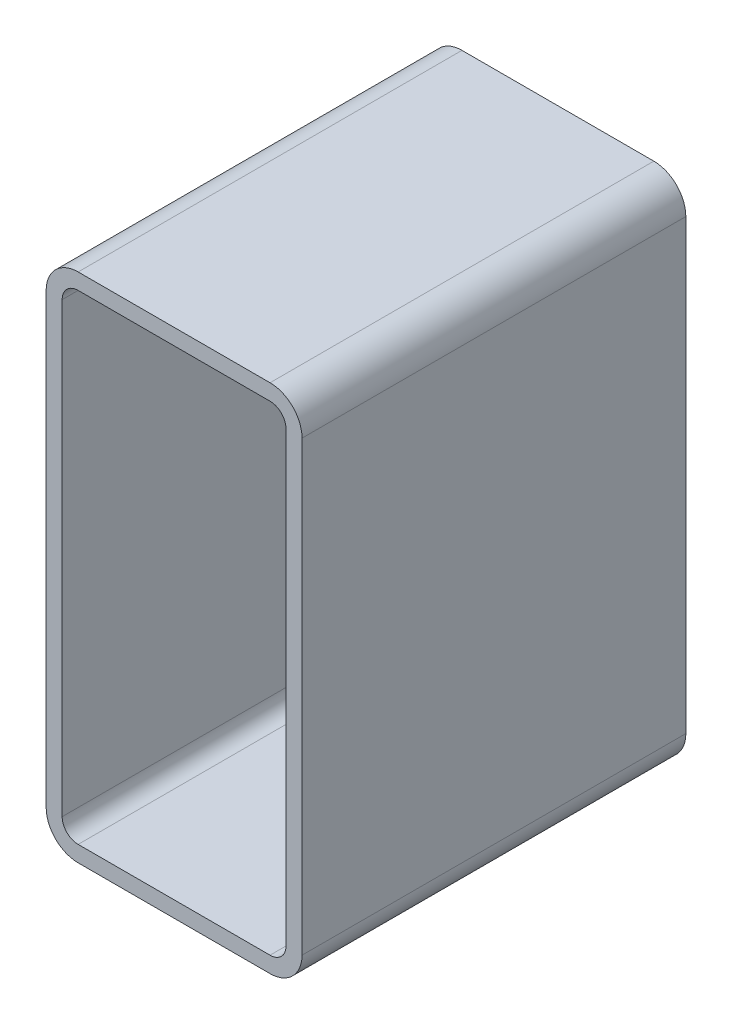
ISO-10303-21;
HEADER;
FILE_DESCRIPTION(('STEP AP214'),'2;1');
FILE_NAME('part.step','',(''),(''),'','','');
FILE_SCHEMA(('AUTOMOTIVE_DESIGN { 1 0 10303 214 1 1 1 1 }'));
ENDSEC;
DATA;
#1=APPLICATION_CONTEXT('core data for automotive mechanical design processes');
#2=APPLICATION_PROTOCOL_DEFINITION('international standard','automotive_design',2000,#1);
#3=PRODUCT_CONTEXT('',#1,'mechanical');
#4=PRODUCT('Part','Part','',(#3));
#5=PRODUCT_RELATED_PRODUCT_CATEGORY('part','',(#4));
#6=PRODUCT_DEFINITION_FORMATION('','',#4);
#7=PRODUCT_DEFINITION_CONTEXT('part definition',#1,'design');
#8=PRODUCT_DEFINITION('design','',#6,#7);
#9=PRODUCT_DEFINITION_SHAPE('','',#8);
#10=(LENGTH_UNIT() NAMED_UNIT(*) SI_UNIT(.MILLI.,.METRE.));
#11=(NAMED_UNIT(*) PLANE_ANGLE_UNIT() SI_UNIT($,.RADIAN.));
#12=(NAMED_UNIT(*) SI_UNIT($,.STERADIAN.) SOLID_ANGLE_UNIT());
#13=UNCERTAINTY_MEASURE_WITH_UNIT(LENGTH_MEASURE(1.E-05),#10,'distance_accuracy_value','');
#14=(GEOMETRIC_REPRESENTATION_CONTEXT(3) GLOBAL_UNCERTAINTY_ASSIGNED_CONTEXT((#13)) GLOBAL_UNIT_ASSIGNED_CONTEXT((#10,
#11,#12)) REPRESENTATION_CONTEXT('',''));
#15=CARTESIAN_POINT('',(0.,0.,0.));
#16=DIRECTION('',(0.,0.,1.));
#17=DIRECTION('',(1.,0.,0.));
#18=AXIS2_PLACEMENT_3D('',#15,#16,#17);
#19=CARTESIAN_POINT('',(26.7909404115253,382.78286249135,304.8));
#20=DIRECTION('',(0.,0.,1.));
#21=DIRECTION('',(1.,0.,0.));
#22=AXIS2_PLACEMENT_3D('',#19,#20,#21);
#23=PLANE('',#22);
#24=CARTESIAN_POINT('',(26.7909404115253,382.78286249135,304.8));
#25=DIRECTION('',(0.,0.,1.));
#26=DIRECTION('',(1.,0.,0.));
#27=AXIS2_PLACEMENT_3D('',#24,#25,#26);
#28=CIRCLE('',#27,25.4);
#29=CARTESIAN_POINT('',(26.7909404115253,408.18286249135,304.8));
#30=VERTEX_POINT('',#29);
#31=CARTESIAN_POINT('',(1.3909404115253,382.78286249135,304.8));
#32=VERTEX_POINT('',#31);
#33=EDGE_CURVE('E211',#30,#32,#28,.T.);
#34=ORIENTED_EDGE('',*,*,#33,.T.);
#35=DIRECTION('',(0.,-1.,0.));
#36=VECTOR('',#35,1.);
#37=CARTESIAN_POINT('',(1.3909404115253,27.1828624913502,304.8));
#38=LINE('',#37,#36);
#39=CARTESIAN_POINT('',(1.3909404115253,27.1828624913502,304.8));
#40=VERTEX_POINT('',#39);
#41=EDGE_CURVE('E214',#32,#40,#38,.T.);
#42=ORIENTED_EDGE('',*,*,#41,.T.);
#43=CARTESIAN_POINT('',(26.7909404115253,27.1828624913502,304.8));
#44=DIRECTION('',(0.,0.,1.));
#45=DIRECTION('',(1.,0.,0.));
#46=AXIS2_PLACEMENT_3D('',#43,#44,#45);
#47=CIRCLE('',#46,25.4);
#48=CARTESIAN_POINT('',(26.7909404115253,1.78286249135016,304.8));
#49=VERTEX_POINT('',#48);
#50=EDGE_CURVE('E217',#40,#49,#47,.T.);
#51=ORIENTED_EDGE('',*,*,#50,.T.);
#52=DIRECTION('',(1.,0.,0.));
#53=VECTOR('',#52,1.);
#54=CARTESIAN_POINT('',(179.190940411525,1.78286249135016,304.8));
#55=LINE('',#54,#53);
#56=CARTESIAN_POINT('',(179.190940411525,1.78286249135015,304.8));
#57=VERTEX_POINT('',#56);
#58=EDGE_CURVE('E219',#49,#57,#55,.T.);
#59=ORIENTED_EDGE('',*,*,#58,.T.);
#60=CARTESIAN_POINT('',(179.190940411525,27.1828624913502,304.8));
#61=DIRECTION('',(0.,0.,1.));
#62=DIRECTION('',(1.,0.,0.));
#63=AXIS2_PLACEMENT_3D('',#60,#61,#62);
#64=CIRCLE('',#63,25.4);
#65=CARTESIAN_POINT('',(204.590940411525,27.1828624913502,304.8));
#66=VERTEX_POINT('',#65);
#67=EDGE_CURVE('E221',#57,#66,#64,.T.);
#68=ORIENTED_EDGE('',*,*,#67,.T.);
#69=DIRECTION('',(0.,1.,0.));
#70=VECTOR('',#69,1.);
#71=CARTESIAN_POINT('',(204.590940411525,382.78286249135,304.8));
#72=LINE('',#71,#70);
#73=CARTESIAN_POINT('',(204.590940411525,382.78286249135,304.8));
#74=VERTEX_POINT('',#73);
#75=EDGE_CURVE('E223',#66,#74,#72,.T.);
#76=ORIENTED_EDGE('',*,*,#75,.T.);
#77=CARTESIAN_POINT('',(179.190940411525,382.78286249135,304.8));
#78=DIRECTION('',(0.,0.,1.));
#79=DIRECTION('',(1.,0.,0.));
#80=AXIS2_PLACEMENT_3D('',#77,#78,#79);
#81=CIRCLE('',#80,25.4);
#82=CARTESIAN_POINT('',(179.190940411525,408.18286249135,304.8));
#83=VERTEX_POINT('',#82);
#84=EDGE_CURVE('E225',#74,#83,#81,.T.);
#85=ORIENTED_EDGE('',*,*,#84,.T.);
#86=DIRECTION('',(-1.,0.,0.));
#87=VECTOR('',#86,1.);
#88=CARTESIAN_POINT('',(26.7909404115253,408.18286249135,304.8));
#89=LINE('',#88,#87);
#90=EDGE_CURVE('E227',#83,#30,#89,.T.);
#91=ORIENTED_EDGE('',*,*,#90,.T.);
#92=EDGE_LOOP('',(#34,#42,#51,#59,#68,#76,#85,#91));
#93=FACE_BOUND('',#92,.T.);
#94=DIRECTION('',(0.,-1.,0.));
#95=VECTOR('',#94,1.);
#96=CARTESIAN_POINT('',(14.0909404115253,27.1828624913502,304.8));
#97=LINE('',#96,#95);
#98=CARTESIAN_POINT('',(14.0909404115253,382.78286249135,304.8));
#99=VERTEX_POINT('',#98);
#100=CARTESIAN_POINT('',(14.0909404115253,27.1828624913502,304.8));
#101=VERTEX_POINT('',#100);
#102=EDGE_CURVE('E154',#99,#101,#97,.T.);
#103=ORIENTED_EDGE('',*,*,#102,.F.);
#104=CARTESIAN_POINT('',(26.7909404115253,382.78286249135,304.8));
#105=DIRECTION('',(0.,0.,1.));
#106=DIRECTION('',(1.,0.,0.));
#107=AXIS2_PLACEMENT_3D('',#104,#105,#106);
#108=CIRCLE('',#107,12.7);
#109=CARTESIAN_POINT('',(26.7909404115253,395.48286249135,304.8));
#110=VERTEX_POINT('',#109);
#111=EDGE_CURVE('E146',#110,#99,#108,.T.);
#112=ORIENTED_EDGE('',*,*,#111,.F.);
#113=DIRECTION('',(-1.,0.,0.));
#114=VECTOR('',#113,1.);
#115=CARTESIAN_POINT('',(26.7909404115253,395.48286249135,304.8));
#116=LINE('',#115,#114);
#117=CARTESIAN_POINT('',(179.190940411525,395.48286249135,304.8));
#118=VERTEX_POINT('',#117);
#119=EDGE_CURVE('E179',#118,#110,#116,.T.);
#120=ORIENTED_EDGE('',*,*,#119,.F.);
#121=CARTESIAN_POINT('',(179.190940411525,382.78286249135,304.8));
#122=DIRECTION('',(0.,0.,1.));
#123=DIRECTION('',(1.,0.,0.));
#124=AXIS2_PLACEMENT_3D('',#121,#122,#123);
#125=CIRCLE('',#124,12.7000000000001);
#126=CARTESIAN_POINT('',(191.890940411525,382.78286249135,304.8));
#127=VERTEX_POINT('',#126);
#128=EDGE_CURVE('E177',#127,#118,#125,.T.);
#129=ORIENTED_EDGE('',*,*,#128,.F.);
#130=DIRECTION('',(0.,1.,0.));
#131=VECTOR('',#130,1.);
#132=CARTESIAN_POINT('',(191.890940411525,382.78286249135,304.8));
#133=LINE('',#132,#131);
#134=CARTESIAN_POINT('',(191.890940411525,27.1828624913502,304.8));
#135=VERTEX_POINT('',#134);
#136=EDGE_CURVE('E175',#135,#127,#133,.T.);
#137=ORIENTED_EDGE('',*,*,#136,.F.);
#138=CARTESIAN_POINT('',(179.190940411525,27.1828624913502,304.8));
#139=DIRECTION('',(0.,0.,1.));
#140=DIRECTION('',(1.,0.,0.));
#141=AXIS2_PLACEMENT_3D('',#138,#139,#140);
#142=CIRCLE('',#141,12.7);
#143=CARTESIAN_POINT('',(179.190940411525,14.4828624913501,304.8));
#144=VERTEX_POINT('',#143);
#145=EDGE_CURVE('E173',#144,#135,#142,.T.);
#146=ORIENTED_EDGE('',*,*,#145,.F.);
#147=DIRECTION('',(1.,0.,0.));
#148=VECTOR('',#147,1.);
#149=CARTESIAN_POINT('',(179.190940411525,14.4828624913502,304.8));
#150=LINE('',#149,#148);
#151=CARTESIAN_POINT('',(26.7909404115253,14.4828624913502,304.8));
#152=VERTEX_POINT('',#151);
#153=EDGE_CURVE('E169',#152,#144,#150,.T.);
#154=ORIENTED_EDGE('',*,*,#153,.F.);
#155=CARTESIAN_POINT('',(26.7909404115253,27.1828624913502,304.8));
#156=DIRECTION('',(0.,0.,1.));
#157=DIRECTION('',(1.,0.,0.));
#158=AXIS2_PLACEMENT_3D('',#155,#156,#157);
#159=CIRCLE('',#158,12.7);
#160=EDGE_CURVE('E167',#101,#152,#159,.T.);
#161=ORIENTED_EDGE('',*,*,#160,.F.);
#162=EDGE_LOOP('',(#103,#112,#120,#129,#137,#146,#154,#161));
#163=FACE_BOUND('',#162,.T.);
#164=ADVANCED_FACE('F33',(#93,#163),#23,.T.);
#165=CARTESIAN_POINT('',(26.7909404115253,382.78286249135,0.));
#166=DIRECTION('',(0.,0.,1.));
#167=DIRECTION('',(1.,0.,0.));
#168=AXIS2_PLACEMENT_3D('',#165,#166,#167);
#169=PLANE('',#168);
#170=CARTESIAN_POINT('',(26.7909404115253,382.78286249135,0.));
#171=DIRECTION('',(0.,0.,1.));
#172=DIRECTION('',(1.,0.,0.));
#173=AXIS2_PLACEMENT_3D('',#170,#171,#172);
#174=CIRCLE('',#173,25.4);
#175=CARTESIAN_POINT('',(26.7909404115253,408.18286249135,0.));
#176=VERTEX_POINT('',#175);
#177=CARTESIAN_POINT('',(1.3909404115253,382.78286249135,0.));
#178=VERTEX_POINT('',#177);
#179=EDGE_CURVE('E162',#176,#178,#174,.T.);
#180=ORIENTED_EDGE('',*,*,#179,.F.);
#181=DIRECTION('',(-1.,0.,0.));
#182=VECTOR('',#181,1.);
#183=CARTESIAN_POINT('',(26.7909404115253,408.18286249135,0.));
#184=LINE('',#183,#182);
#185=CARTESIAN_POINT('',(179.190940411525,408.18286249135,0.));
#186=VERTEX_POINT('',#185);
#187=EDGE_CURVE('E215',#186,#176,#184,.T.);
#188=ORIENTED_EDGE('',*,*,#187,.F.);
#189=CARTESIAN_POINT('',(179.190940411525,382.78286249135,0.));
#190=DIRECTION('',(0.,0.,1.));
#191=DIRECTION('',(1.,0.,0.));
#192=AXIS2_PLACEMENT_3D('',#189,#190,#191);
#193=CIRCLE('',#192,25.4);
#194=CARTESIAN_POINT('',(204.590940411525,382.78286249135,0.));
#195=VERTEX_POINT('',#194);
#196=EDGE_CURVE('E242',#195,#186,#193,.T.);
#197=ORIENTED_EDGE('',*,*,#196,.F.);
#198=DIRECTION('',(0.,1.,0.));
#199=VECTOR('',#198,1.);
#200=CARTESIAN_POINT('',(204.590940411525,382.78286249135,0.));
#201=LINE('',#200,#199);
#202=CARTESIAN_POINT('',(204.590940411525,27.1828624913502,0.));
#203=VERTEX_POINT('',#202);
#204=EDGE_CURVE('E240',#203,#195,#201,.T.);
#205=ORIENTED_EDGE('',*,*,#204,.F.);
#206=CARTESIAN_POINT('',(179.190940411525,27.1828624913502,0.));
#207=DIRECTION('',(0.,0.,1.));
#208=DIRECTION('',(1.,0.,0.));
#209=AXIS2_PLACEMENT_3D('',#206,#207,#208);
#210=CIRCLE('',#209,25.4);
#211=CARTESIAN_POINT('',(179.190940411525,1.78286249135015,0.));
#212=VERTEX_POINT('',#211);
#213=EDGE_CURVE('E238',#212,#203,#210,.T.);
#214=ORIENTED_EDGE('',*,*,#213,.F.);
#215=DIRECTION('',(1.,0.,0.));
#216=VECTOR('',#215,1.);
#217=CARTESIAN_POINT('',(179.190940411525,1.78286249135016,0.));
#218=LINE('',#217,#216);
#219=CARTESIAN_POINT('',(26.7909404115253,1.78286249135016,0.));
#220=VERTEX_POINT('',#219);
#221=EDGE_CURVE('E236',#220,#212,#218,.T.);
#222=ORIENTED_EDGE('',*,*,#221,.F.);
#223=CARTESIAN_POINT('',(26.7909404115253,27.1828624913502,0.));
#224=DIRECTION('',(0.,0.,1.));
#225=DIRECTION('',(1.,0.,0.));
#226=AXIS2_PLACEMENT_3D('',#223,#224,#225);
#227=CIRCLE('',#226,25.4);
#228=CARTESIAN_POINT('',(1.3909404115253,27.1828624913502,0.));
#229=VERTEX_POINT('',#228);
#230=EDGE_CURVE('E234',#229,#220,#227,.T.);
#231=ORIENTED_EDGE('',*,*,#230,.F.);
#232=DIRECTION('',(0.,-1.,0.));
#233=VECTOR('',#232,1.);
#234=CARTESIAN_POINT('',(1.3909404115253,27.1828624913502,0.));
#235=LINE('',#234,#233);
#236=EDGE_CURVE('E232',#178,#229,#235,.T.);
#237=ORIENTED_EDGE('',*,*,#236,.F.);
#238=EDGE_LOOP('',(#180,#188,#197,#205,#214,#222,#231,#237));
#239=FACE_BOUND('',#238,.T.);
#240=CARTESIAN_POINT('',(26.7909404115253,382.78286249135,0.));
#241=DIRECTION('',(0.,0.,1.));
#242=DIRECTION('',(1.,0.,0.));
#243=AXIS2_PLACEMENT_3D('',#240,#241,#242);
#244=CIRCLE('',#243,12.7);
#245=CARTESIAN_POINT('',(26.7909404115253,395.48286249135,0.));
#246=VERTEX_POINT('',#245);
#247=CARTESIAN_POINT('',(14.0909404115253,382.78286249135,0.));
#248=VERTEX_POINT('',#247);
#249=EDGE_CURVE('E56',#246,#248,#244,.T.);
#250=ORIENTED_EDGE('',*,*,#249,.T.);
#251=DIRECTION('',(0.,-1.,0.));
#252=VECTOR('',#251,1.);
#253=CARTESIAN_POINT('',(14.0909404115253,27.1828624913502,0.));
#254=LINE('',#253,#252);
#255=CARTESIAN_POINT('',(14.0909404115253,27.1828624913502,0.));
#256=VERTEX_POINT('',#255);
#257=EDGE_CURVE('E161',#248,#256,#254,.T.);
#258=ORIENTED_EDGE('',*,*,#257,.T.);
#259=CARTESIAN_POINT('',(26.7909404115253,27.1828624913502,0.));
#260=DIRECTION('',(0.,0.,1.));
#261=DIRECTION('',(1.,0.,0.));
#262=AXIS2_PLACEMENT_3D('',#259,#260,#261);
#263=CIRCLE('',#262,12.7);
#264=CARTESIAN_POINT('',(26.7909404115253,14.4828624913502,0.));
#265=VERTEX_POINT('',#264);
#266=EDGE_CURVE('E183',#256,#265,#263,.T.);
#267=ORIENTED_EDGE('',*,*,#266,.T.);
#268=DIRECTION('',(1.,0.,0.));
#269=VECTOR('',#268,1.);
#270=CARTESIAN_POINT('',(179.190940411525,14.4828624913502,0.));
#271=LINE('',#270,#269);
#272=CARTESIAN_POINT('',(179.190940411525,14.4828624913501,0.));
#273=VERTEX_POINT('',#272);
#274=EDGE_CURVE('E186',#265,#273,#271,.T.);
#275=ORIENTED_EDGE('',*,*,#274,.T.);
#276=CARTESIAN_POINT('',(179.190940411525,27.1828624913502,0.));
#277=DIRECTION('',(0.,0.,1.));
#278=DIRECTION('',(1.,0.,0.));
#279=AXIS2_PLACEMENT_3D('',#276,#277,#278);
#280=CIRCLE('',#279,12.7);
#281=CARTESIAN_POINT('',(191.890940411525,27.1828624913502,0.));
#282=VERTEX_POINT('',#281);
#283=EDGE_CURVE('E189',#273,#282,#280,.T.);
#284=ORIENTED_EDGE('',*,*,#283,.T.);
#285=DIRECTION('',(0.,1.,0.));
#286=VECTOR('',#285,1.);
#287=CARTESIAN_POINT('',(191.890940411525,382.78286249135,0.));
#288=LINE('',#287,#286);
#289=CARTESIAN_POINT('',(191.890940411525,382.78286249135,0.));
#290=VERTEX_POINT('',#289);
#291=EDGE_CURVE('E192',#282,#290,#288,.T.);
#292=ORIENTED_EDGE('',*,*,#291,.T.);
#293=CARTESIAN_POINT('',(179.190940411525,382.78286249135,0.));
#294=DIRECTION('',(0.,0.,1.));
#295=DIRECTION('',(1.,0.,0.));
#296=AXIS2_PLACEMENT_3D('',#293,#294,#295);
#297=CIRCLE('',#296,12.7000000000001);
#298=CARTESIAN_POINT('',(179.190940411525,395.48286249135,0.));
#299=VERTEX_POINT('',#298);
#300=EDGE_CURVE('E195',#290,#299,#297,.T.);
#301=ORIENTED_EDGE('',*,*,#300,.T.);
#302=DIRECTION('',(-1.,0.,0.));
#303=VECTOR('',#302,1.);
#304=CARTESIAN_POINT('',(26.7909404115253,395.48286249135,0.));
#305=LINE('',#304,#303);
#306=EDGE_CURVE('E155',#299,#246,#305,.T.);
#307=ORIENTED_EDGE('',*,*,#306,.T.);
#308=EDGE_LOOP('',(#250,#258,#267,#275,#284,#292,#301,#307));
#309=FACE_BOUND('',#308,.T.);
#310=ADVANCED_FACE('F272',(#239,#309),#169,.F.);
#311=CARTESIAN_POINT('',(26.7909404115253,382.78286249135,304.8));
#312=DIRECTION('',(0.,0.,-1.));
#313=DIRECTION('',(-1.,0.,0.));
#314=AXIS2_PLACEMENT_3D('',#311,#312,#313);
#315=CYLINDRICAL_SURFACE('',#314,25.4);
#316=ORIENTED_EDGE('',*,*,#179,.T.);
#317=DIRECTION('',(0.,0.,-1.));
#318=VECTOR('',#317,1.);
#319=CARTESIAN_POINT('',(1.3909404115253,382.78286249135,304.8));
#320=LINE('',#319,#318);
#321=EDGE_CURVE('E11',#32,#178,#320,.T.);
#322=ORIENTED_EDGE('',*,*,#321,.F.);
#323=ORIENTED_EDGE('',*,*,#33,.F.);
#324=DIRECTION('',(0.,0.,-1.));
#325=VECTOR('',#324,1.);
#326=CARTESIAN_POINT('',(26.7909404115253,408.18286249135,304.8));
#327=LINE('',#326,#325);
#328=EDGE_CURVE('E229',#30,#176,#327,.T.);
#329=ORIENTED_EDGE('',*,*,#328,.T.);
#330=EDGE_LOOP('',(#316,#322,#323,#329));
#331=FACE_BOUND('',#330,.T.);
#332=ADVANCED_FACE('F35',(#331),#315,.T.);
#333=CARTESIAN_POINT('',(1.3909404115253,27.1828624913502,304.8));
#334=DIRECTION('',(1.,0.,0.));
#335=DIRECTION('',(0.,0.,-1.));
#336=AXIS2_PLACEMENT_3D('',#333,#334,#335);
#337=PLANE('',#336);
#338=ORIENTED_EDGE('',*,*,#236,.T.);
#339=DIRECTION('',(0.,0.,-1.));
#340=VECTOR('',#339,1.);
#341=CARTESIAN_POINT('',(1.3909404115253,27.1828624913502,304.8));
#342=LINE('',#341,#340);
#343=EDGE_CURVE('E41',#40,#229,#342,.T.);
#344=ORIENTED_EDGE('',*,*,#343,.F.);
#345=ORIENTED_EDGE('',*,*,#41,.F.);
#346=ORIENTED_EDGE('',*,*,#321,.T.);
#347=EDGE_LOOP('',(#338,#344,#345,#346));
#348=FACE_BOUND('',#347,.T.);
#349=ADVANCED_FACE('F289',(#348),#337,.F.);
#350=CARTESIAN_POINT('',(26.7909404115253,27.1828624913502,304.8));
#351=DIRECTION('',(0.,0.,-1.));
#352=DIRECTION('',(-1.,0.,0.));
#353=AXIS2_PLACEMENT_3D('',#350,#351,#352);
#354=CYLINDRICAL_SURFACE('',#353,25.4);
#355=ORIENTED_EDGE('',*,*,#230,.T.);
#356=DIRECTION('',(0.,0.,-1.));
#357=VECTOR('',#356,1.);
#358=CARTESIAN_POINT('',(26.7909404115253,1.78286249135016,304.8));
#359=LINE('',#358,#357);
#360=EDGE_CURVE('E259',#49,#220,#359,.T.);
#361=ORIENTED_EDGE('',*,*,#360,.F.);
#362=ORIENTED_EDGE('',*,*,#50,.F.);
#363=ORIENTED_EDGE('',*,*,#343,.T.);
#364=EDGE_LOOP('',(#355,#361,#362,#363));
#365=FACE_BOUND('',#364,.T.);
#366=ADVANCED_FACE('F266',(#365),#354,.T.);
#367=CARTESIAN_POINT('',(179.190940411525,1.78286249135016,304.8));
#368=DIRECTION('',(0.,1.,0.));
#369=DIRECTION('',(0.,0.,1.));
#370=AXIS2_PLACEMENT_3D('',#367,#368,#369);
#371=PLANE('',#370);
#372=ORIENTED_EDGE('',*,*,#221,.T.);
#373=DIRECTION('',(0.,0.,-1.));
#374=VECTOR('',#373,1.);
#375=CARTESIAN_POINT('',(179.190940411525,1.78286249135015,304.8));
#376=LINE('',#375,#374);
#377=EDGE_CURVE('E256',#57,#212,#376,.T.);
#378=ORIENTED_EDGE('',*,*,#377,.F.);
#379=ORIENTED_EDGE('',*,*,#58,.F.);
#380=ORIENTED_EDGE('',*,*,#360,.T.);
#381=EDGE_LOOP('',(#372,#378,#379,#380));
#382=FACE_BOUND('',#381,.T.);
#383=ADVANCED_FACE('F278',(#382),#371,.F.);
#384=CARTESIAN_POINT('',(179.190940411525,27.1828624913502,304.8));
#385=DIRECTION('',(0.,0.,-1.));
#386=DIRECTION('',(-1.,0.,0.));
#387=AXIS2_PLACEMENT_3D('',#384,#385,#386);
#388=CYLINDRICAL_SURFACE('',#387,25.4);
#389=ORIENTED_EDGE('',*,*,#213,.T.);
#390=DIRECTION('',(0.,0.,-1.));
#391=VECTOR('',#390,1.);
#392=CARTESIAN_POINT('',(204.590940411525,27.1828624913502,304.8));
#393=LINE('',#392,#391);
#394=EDGE_CURVE('E253',#66,#203,#393,.T.);
#395=ORIENTED_EDGE('',*,*,#394,.F.);
#396=ORIENTED_EDGE('',*,*,#67,.F.);
#397=ORIENTED_EDGE('',*,*,#377,.T.);
#398=EDGE_LOOP('',(#389,#395,#396,#397));
#399=FACE_BOUND('',#398,.T.);
#400=ADVANCED_FACE('F282',(#399),#388,.T.);
#401=CARTESIAN_POINT('',(204.590940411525,382.78286249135,304.8));
#402=DIRECTION('',(-1.,0.,0.));
#403=DIRECTION('',(0.,0.,1.));
#404=AXIS2_PLACEMENT_3D('',#401,#402,#403);
#405=PLANE('',#404);
#406=ORIENTED_EDGE('',*,*,#204,.T.);
#407=DIRECTION('',(0.,0.,-1.));
#408=VECTOR('',#407,1.);
#409=CARTESIAN_POINT('',(204.590940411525,382.78286249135,304.8));
#410=LINE('',#409,#408);
#411=EDGE_CURVE('E250',#74,#195,#410,.T.);
#412=ORIENTED_EDGE('',*,*,#411,.F.);
#413=ORIENTED_EDGE('',*,*,#75,.F.);
#414=ORIENTED_EDGE('',*,*,#394,.T.);
#415=EDGE_LOOP('',(#406,#412,#413,#414));
#416=FACE_BOUND('',#415,.T.);
#417=ADVANCED_FACE('F302',(#416),#405,.F.);
#418=CARTESIAN_POINT('',(179.190940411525,382.78286249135,304.8));
#419=DIRECTION('',(0.,0.,-1.));
#420=DIRECTION('',(-1.,0.,0.));
#421=AXIS2_PLACEMENT_3D('',#418,#419,#420);
#422=CYLINDRICAL_SURFACE('',#421,25.4);
#423=ORIENTED_EDGE('',*,*,#196,.T.);
#424=DIRECTION('',(0.,0.,-1.));
#425=VECTOR('',#424,1.);
#426=CARTESIAN_POINT('',(179.190940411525,408.18286249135,304.8));
#427=LINE('',#426,#425);
#428=EDGE_CURVE('E247',#83,#186,#427,.T.);
#429=ORIENTED_EDGE('',*,*,#428,.F.);
#430=ORIENTED_EDGE('',*,*,#84,.F.);
#431=ORIENTED_EDGE('',*,*,#411,.T.);
#432=EDGE_LOOP('',(#423,#429,#430,#431));
#433=FACE_BOUND('',#432,.T.);
#434=ADVANCED_FACE('F300',(#433),#422,.T.);
#435=CARTESIAN_POINT('',(26.7909404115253,408.18286249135,304.8));
#436=DIRECTION('',(0.,-1.,0.));
#437=DIRECTION('',(0.,0.,-1.));
#438=AXIS2_PLACEMENT_3D('',#435,#436,#437);
#439=PLANE('',#438);
#440=ORIENTED_EDGE('',*,*,#187,.T.);
#441=ORIENTED_EDGE('',*,*,#328,.F.);
#442=ORIENTED_EDGE('',*,*,#90,.F.);
#443=ORIENTED_EDGE('',*,*,#428,.T.);
#444=EDGE_LOOP('',(#440,#441,#442,#443));
#445=FACE_BOUND('',#444,.T.);
#446=ADVANCED_FACE('F295',(#445),#439,.F.);
#447=CARTESIAN_POINT('',(26.7909404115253,382.78286249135,304.8));
#448=DIRECTION('',(0.,0.,-1.));
#449=DIRECTION('',(-1.,0.,0.));
#450=AXIS2_PLACEMENT_3D('',#447,#448,#449);
#451=CYLINDRICAL_SURFACE('',#450,12.7);
#452=ORIENTED_EDGE('',*,*,#249,.F.);
#453=DIRECTION('',(0.,0.,-1.));
#454=VECTOR('',#453,1.);
#455=CARTESIAN_POINT('',(26.7909404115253,395.48286249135,304.8));
#456=LINE('',#455,#454);
#457=EDGE_CURVE('E150',#110,#246,#456,.T.);
#458=ORIENTED_EDGE('',*,*,#457,.F.);
#459=ORIENTED_EDGE('',*,*,#111,.T.);
#460=DIRECTION('',(0.,0.,-1.));
#461=VECTOR('',#460,1.);
#462=CARTESIAN_POINT('',(14.0909404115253,382.78286249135,304.8));
#463=LINE('',#462,#461);
#464=EDGE_CURVE('E149',#99,#248,#463,.T.);
#465=ORIENTED_EDGE('',*,*,#464,.T.);
#466=EDGE_LOOP('',(#452,#458,#459,#465));
#467=FACE_BOUND('',#466,.T.);
#468=ADVANCED_FACE('F148',(#467),#451,.F.);
#469=CARTESIAN_POINT('',(14.0909404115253,27.1828624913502,304.8));
#470=DIRECTION('',(1.,0.,0.));
#471=DIRECTION('',(0.,0.,-1.));
#472=AXIS2_PLACEMENT_3D('',#469,#470,#471);
#473=PLANE('',#472);
#474=ORIENTED_EDGE('',*,*,#257,.F.);
#475=ORIENTED_EDGE('',*,*,#464,.F.);
#476=ORIENTED_EDGE('',*,*,#102,.T.);
#477=DIRECTION('',(0.,0.,-1.));
#478=VECTOR('',#477,1.);
#479=CARTESIAN_POINT('',(14.0909404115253,27.1828624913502,304.8));
#480=LINE('',#479,#478);
#481=EDGE_CURVE('E163',#101,#256,#480,.T.);
#482=ORIENTED_EDGE('',*,*,#481,.T.);
#483=EDGE_LOOP('',(#474,#475,#476,#482));
#484=FACE_BOUND('',#483,.T.);
#485=ADVANCED_FACE('F158',(#484),#473,.T.);
#486=CARTESIAN_POINT('',(26.7909404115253,27.1828624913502,304.8));
#487=DIRECTION('',(0.,0.,-1.));
#488=DIRECTION('',(-1.,0.,0.));
#489=AXIS2_PLACEMENT_3D('',#486,#487,#488);
#490=CYLINDRICAL_SURFACE('',#489,12.7);
#491=ORIENTED_EDGE('',*,*,#266,.F.);
#492=ORIENTED_EDGE('',*,*,#481,.F.);
#493=ORIENTED_EDGE('',*,*,#160,.T.);
#494=DIRECTION('',(0.,0.,-1.));
#495=VECTOR('',#494,1.);
#496=CARTESIAN_POINT('',(26.7909404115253,14.4828624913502,304.8));
#497=LINE('',#496,#495);
#498=EDGE_CURVE('E208',#152,#265,#497,.T.);
#499=ORIENTED_EDGE('',*,*,#498,.T.);
#500=EDGE_LOOP('',(#491,#492,#493,#499));
#501=FACE_BOUND('',#500,.T.);
#502=ADVANCED_FACE('F327',(#501),#490,.F.);
#503=CARTESIAN_POINT('',(179.190940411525,14.4828624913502,304.8));
#504=DIRECTION('',(0.,1.,0.));
#505=DIRECTION('',(0.,0.,1.));
#506=AXIS2_PLACEMENT_3D('',#503,#504,#505);
#507=PLANE('',#506);
#508=ORIENTED_EDGE('',*,*,#274,.F.);
#509=ORIENTED_EDGE('',*,*,#498,.F.);
#510=ORIENTED_EDGE('',*,*,#153,.T.);
#511=DIRECTION('',(0.,0.,-1.));
#512=VECTOR('',#511,1.);
#513=CARTESIAN_POINT('',(179.190940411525,14.4828624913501,304.8));
#514=LINE('',#513,#512);
#515=EDGE_CURVE('E206',#144,#273,#514,.T.);
#516=ORIENTED_EDGE('',*,*,#515,.T.);
#517=EDGE_LOOP('',(#508,#509,#510,#516));
#518=FACE_BOUND('',#517,.T.);
#519=ADVANCED_FACE('F331',(#518),#507,.T.);
#520=CARTESIAN_POINT('',(179.190940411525,27.1828624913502,304.8));
#521=DIRECTION('',(0.,0.,-1.));
#522=DIRECTION('',(-1.,0.,0.));
#523=AXIS2_PLACEMENT_3D('',#520,#521,#522);
#524=CYLINDRICAL_SURFACE('',#523,12.7);
#525=ORIENTED_EDGE('',*,*,#283,.F.);
#526=ORIENTED_EDGE('',*,*,#515,.F.);
#527=ORIENTED_EDGE('',*,*,#145,.T.);
#528=DIRECTION('',(0.,0.,-1.));
#529=VECTOR('',#528,1.);
#530=CARTESIAN_POINT('',(191.890940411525,27.1828624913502,304.8));
#531=LINE('',#530,#529);
#532=EDGE_CURVE('E204',#135,#282,#531,.T.);
#533=ORIENTED_EDGE('',*,*,#532,.T.);
#534=EDGE_LOOP('',(#525,#526,#527,#533));
#535=FACE_BOUND('',#534,.T.);
#536=ADVANCED_FACE('F337',(#535),#524,.F.);
#537=CARTESIAN_POINT('',(191.890940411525,382.78286249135,304.8));
#538=DIRECTION('',(-1.,0.,0.));
#539=DIRECTION('',(0.,0.,1.));
#540=AXIS2_PLACEMENT_3D('',#537,#538,#539);
#541=PLANE('',#540);
#542=ORIENTED_EDGE('',*,*,#291,.F.);
#543=ORIENTED_EDGE('',*,*,#532,.F.);
#544=ORIENTED_EDGE('',*,*,#136,.T.);
#545=DIRECTION('',(0.,0.,-1.));
#546=VECTOR('',#545,1.);
#547=CARTESIAN_POINT('',(191.890940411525,382.78286249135,304.8));
#548=LINE('',#547,#546);
#549=EDGE_CURVE('E202',#127,#290,#548,.T.);
#550=ORIENTED_EDGE('',*,*,#549,.T.);
#551=EDGE_LOOP('',(#542,#543,#544,#550));
#552=FACE_BOUND('',#551,.T.);
#553=ADVANCED_FACE('F341',(#552),#541,.T.);
#554=CARTESIAN_POINT('',(179.190940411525,382.78286249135,304.8));
#555=DIRECTION('',(0.,0.,-1.));
#556=DIRECTION('',(-1.,0.,0.));
#557=AXIS2_PLACEMENT_3D('',#554,#555,#556);
#558=CYLINDRICAL_SURFACE('',#557,12.7000000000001);
#559=ORIENTED_EDGE('',*,*,#300,.F.);
#560=ORIENTED_EDGE('',*,*,#549,.F.);
#561=ORIENTED_EDGE('',*,*,#128,.T.);
#562=DIRECTION('',(0.,0.,-1.));
#563=VECTOR('',#562,1.);
#564=CARTESIAN_POINT('',(179.190940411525,395.48286249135,304.8));
#565=LINE('',#564,#563);
#566=EDGE_CURVE('E48',#118,#299,#565,.T.);
#567=ORIENTED_EDGE('',*,*,#566,.T.);
#568=EDGE_LOOP('',(#559,#560,#561,#567));
#569=FACE_BOUND('',#568,.T.);
#570=ADVANCED_FACE('F345',(#569),#558,.F.);
#571=CARTESIAN_POINT('',(26.7909404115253,395.48286249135,304.8));
#572=DIRECTION('',(0.,-1.,0.));
#573=DIRECTION('',(0.,0.,-1.));
#574=AXIS2_PLACEMENT_3D('',#571,#572,#573);
#575=PLANE('',#574);
#576=ORIENTED_EDGE('',*,*,#306,.F.);
#577=ORIENTED_EDGE('',*,*,#566,.F.);
#578=ORIENTED_EDGE('',*,*,#119,.T.);
#579=ORIENTED_EDGE('',*,*,#457,.T.);
#580=EDGE_LOOP('',(#576,#577,#578,#579));
#581=FACE_BOUND('',#580,.T.);
#582=ADVANCED_FACE('F349',(#581),#575,.T.);
#583=CLOSED_SHELL('',(#164,#310,#332,#349,#366,#383,#400,#417,#434,#446,#468,#485,#502,#519,
#536,#553,#570,#582));
#584=MANIFOLD_SOLID_BREP('B2',#583);
#585=ADVANCED_BREP_SHAPE_REPRESENTATION('',(#18,#584),#14);
#586=SHAPE_DEFINITION_REPRESENTATION(#9,#585);
ENDSEC;
END-ISO-10303-21;
